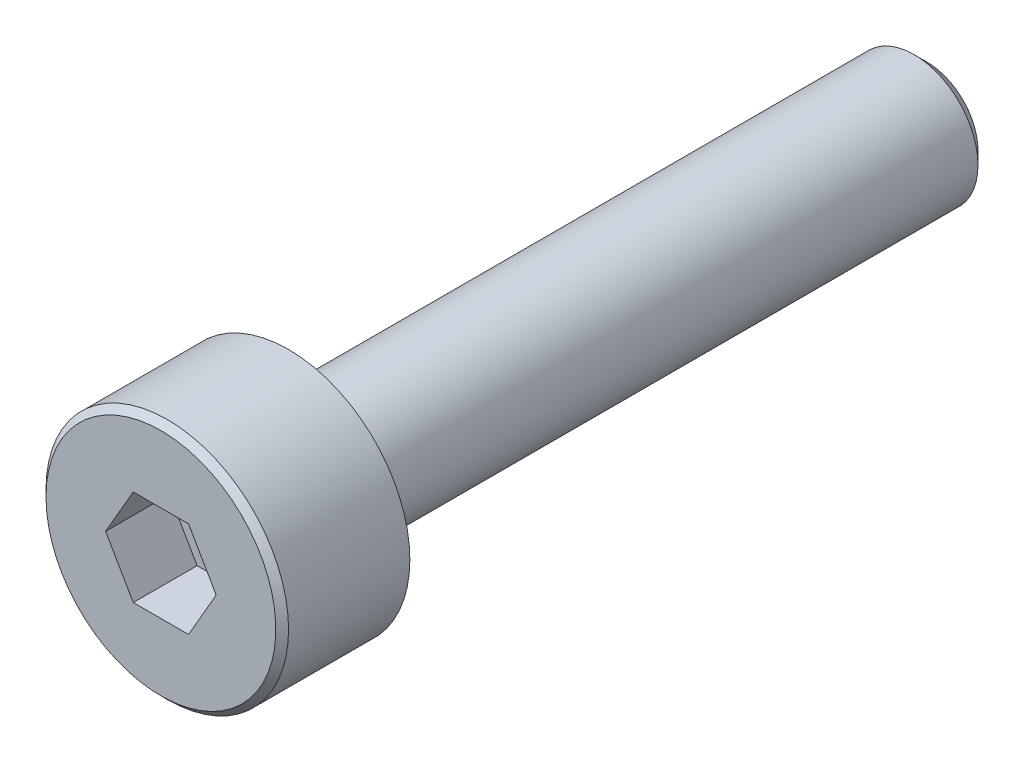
ISO-10303-21;
HEADER;
FILE_DESCRIPTION(('STEP AP214'),'2;1');
FILE_NAME('part.step','',(''),(''),'','','');
FILE_SCHEMA(('AUTOMOTIVE_DESIGN { 1 0 10303 214 1 1 1 1 }'));
ENDSEC;
DATA;
#1=APPLICATION_CONTEXT('core data for automotive mechanical design processes');
#2=APPLICATION_PROTOCOL_DEFINITION('international standard','automotive_design',2000,#1);
#3=PRODUCT_CONTEXT('',#1,'mechanical');
#4=PRODUCT('Part','Part','',(#3));
#5=PRODUCT_RELATED_PRODUCT_CATEGORY('part','',(#4));
#6=PRODUCT_DEFINITION_FORMATION('','',#4);
#7=PRODUCT_DEFINITION_CONTEXT('part definition',#1,'design');
#8=PRODUCT_DEFINITION('design','',#6,#7);
#9=PRODUCT_DEFINITION_SHAPE('','',#8);
#10=(LENGTH_UNIT() NAMED_UNIT(*) SI_UNIT(.MILLI.,.METRE.));
#11=(NAMED_UNIT(*) PLANE_ANGLE_UNIT() SI_UNIT($,.RADIAN.));
#12=(NAMED_UNIT(*) SI_UNIT($,.STERADIAN.) SOLID_ANGLE_UNIT());
#13=UNCERTAINTY_MEASURE_WITH_UNIT(LENGTH_MEASURE(1.E-05),#10,'distance_accuracy_value','');
#14=(GEOMETRIC_REPRESENTATION_CONTEXT(3) GLOBAL_UNCERTAINTY_ASSIGNED_CONTEXT((#13)) GLOBAL_UNIT_ASSIGNED_CONTEXT((#10,
#11,#12)) REPRESENTATION_CONTEXT('',''));
#15=CARTESIAN_POINT('',(0.,0.,0.));
#16=DIRECTION('',(0.,0.,1.));
#17=DIRECTION('',(1.,0.,0.));
#18=AXIS2_PLACEMENT_3D('',#15,#16,#17);
#19=CARTESIAN_POINT('',(-0.433012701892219,-0.75,1.));
#20=DIRECTION('',(0.,0.,-1.));
#21=DIRECTION('',(-1.,0.,0.));
#22=AXIS2_PLACEMENT_3D('',#19,#20,#21);
#23=PLANE('',#22);
#24=DIRECTION('',(-0.5,0.866025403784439,0.));
#25=VECTOR('',#24,1.);
#26=CARTESIAN_POINT('',(0.866025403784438,0.,1.));
#27=LINE('',#26,#25);
#28=CARTESIAN_POINT('',(0.866025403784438,0.,1.));
#29=VERTEX_POINT('',#28);
#30=CARTESIAN_POINT('',(0.433012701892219,0.75,1.));
#31=VERTEX_POINT('',#30);
#32=EDGE_CURVE('E72',#29,#31,#27,.T.);
#33=ORIENTED_EDGE('',*,*,#32,.T.);
#34=DIRECTION('',(-1.,0.,0.));
#35=VECTOR('',#34,1.);
#36=CARTESIAN_POINT('',(0.433012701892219,0.75,1.));
#37=LINE('',#36,#35);
#38=CARTESIAN_POINT('',(-0.433012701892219,0.75,1.));
#39=VERTEX_POINT('',#38);
#40=EDGE_CURVE('E125',#31,#39,#37,.T.);
#41=ORIENTED_EDGE('',*,*,#40,.T.);
#42=DIRECTION('',(-0.5,-0.866025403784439,0.));
#43=VECTOR('',#42,1.);
#44=CARTESIAN_POINT('',(-0.433012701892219,0.75,1.));
#45=LINE('',#44,#43);
#46=CARTESIAN_POINT('',(-0.866025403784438,0.,1.));
#47=VERTEX_POINT('',#46);
#48=EDGE_CURVE('E130',#39,#47,#45,.T.);
#49=ORIENTED_EDGE('',*,*,#48,.T.);
#50=DIRECTION('',(0.5,-0.866025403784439,0.));
#51=VECTOR('',#50,1.);
#52=CARTESIAN_POINT('',(-0.866025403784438,0.,1.));
#53=LINE('',#52,#51);
#54=CARTESIAN_POINT('',(-0.433012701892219,-0.75,1.));
#55=VERTEX_POINT('',#54);
#56=EDGE_CURVE('E134',#47,#55,#53,.T.);
#57=ORIENTED_EDGE('',*,*,#56,.T.);
#58=DIRECTION('',(1.,0.,0.));
#59=VECTOR('',#58,1.);
#60=CARTESIAN_POINT('',(-0.433012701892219,-0.75,1.));
#61=LINE('',#60,#59);
#62=CARTESIAN_POINT('',(0.433012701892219,-0.75,1.));
#63=VERTEX_POINT('',#62);
#64=EDGE_CURVE('E68',#55,#63,#61,.T.);
#65=ORIENTED_EDGE('',*,*,#64,.T.);
#66=DIRECTION('',(0.5,0.866025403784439,0.));
#67=VECTOR('',#66,1.);
#68=CARTESIAN_POINT('',(0.433012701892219,-0.75,1.));
#69=LINE('',#68,#67);
#70=EDGE_CURVE('E70',#63,#29,#69,.T.);
#71=ORIENTED_EDGE('',*,*,#70,.T.);
#72=EDGE_LOOP('',(#33,#41,#49,#57,#65,#71));
#73=FACE_BOUND('',#72,.T.);
#74=ADVANCED_FACE('F17',(#73),#23,.F.);
#75=CARTESIAN_POINT('',(0.866025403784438,0.,1.));
#76=DIRECTION('',(0.866025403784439,0.5,0.));
#77=DIRECTION('',(-0.5,0.866025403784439,0.));
#78=AXIS2_PLACEMENT_3D('',#75,#76,#77);
#79=PLANE('',#78);
#80=ORIENTED_EDGE('',*,*,#32,.F.);
#81=DIRECTION('',(0.,0.,1.));
#82=VECTOR('',#81,1.);
#83=CARTESIAN_POINT('',(0.866025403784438,0.,1.));
#84=LINE('',#83,#82);
#85=CARTESIAN_POINT('',(0.866025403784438,0.,2.));
#86=VERTEX_POINT('',#85);
#87=EDGE_CURVE('E77',#29,#86,#84,.T.);
#88=ORIENTED_EDGE('',*,*,#87,.T.);
#89=DIRECTION('',(0.5,-0.866025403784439,0.));
#90=VECTOR('',#89,1.);
#91=CARTESIAN_POINT('',(0.433012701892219,0.75,2.));
#92=LINE('',#91,#90);
#93=CARTESIAN_POINT('',(0.433012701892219,0.75,2.));
#94=VERTEX_POINT('',#93);
#95=EDGE_CURVE('E122',#94,#86,#92,.T.);
#96=ORIENTED_EDGE('',*,*,#95,.F.);
#97=DIRECTION('',(0.,0.,1.));
#98=VECTOR('',#97,1.);
#99=CARTESIAN_POINT('',(0.433012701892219,0.75,1.));
#100=LINE('',#99,#98);
#101=EDGE_CURVE('E83',#94,#31,#100,.F.);
#102=ORIENTED_EDGE('',*,*,#101,.T.);
#103=EDGE_LOOP('',(#80,#88,#96,#102));
#104=FACE_BOUND('',#103,.T.);
#105=ADVANCED_FACE('F80',(#104),#79,.F.);
#106=CARTESIAN_POINT('',(0.433012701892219,-0.75,1.));
#107=DIRECTION('',(0.866025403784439,-0.5,0.));
#108=DIRECTION('',(0.5,0.866025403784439,0.));
#109=AXIS2_PLACEMENT_3D('',#106,#107,#108);
#110=PLANE('',#109);
#111=ORIENTED_EDGE('',*,*,#70,.F.);
#112=DIRECTION('',(0.,0.,-1.));
#113=VECTOR('',#112,1.);
#114=CARTESIAN_POINT('',(0.433012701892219,-0.75,1.));
#115=LINE('',#114,#113);
#116=CARTESIAN_POINT('',(0.433012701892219,-0.75,2.));
#117=VERTEX_POINT('',#116);
#118=EDGE_CURVE('E91',#63,#117,#115,.F.);
#119=ORIENTED_EDGE('',*,*,#118,.T.);
#120=DIRECTION('',(-0.5,-0.866025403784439,0.));
#121=VECTOR('',#120,1.);
#122=CARTESIAN_POINT('',(0.866025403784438,0.,2.));
#123=LINE('',#122,#121);
#124=EDGE_CURVE('E88',#86,#117,#123,.T.);
#125=ORIENTED_EDGE('',*,*,#124,.F.);
#126=ORIENTED_EDGE('',*,*,#87,.F.);
#127=EDGE_LOOP('',(#111,#119,#125,#126));
#128=FACE_BOUND('',#127,.T.);
#129=ADVANCED_FACE('F86',(#128),#110,.F.);
#130=CARTESIAN_POINT('',(-0.433012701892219,-0.75,1.));
#131=DIRECTION('',(0.,-1.,0.));
#132=DIRECTION('',(0.,0.,-1.));
#133=AXIS2_PLACEMENT_3D('',#130,#131,#132);
#134=PLANE('',#133);
#135=ORIENTED_EDGE('',*,*,#64,.F.);
#136=DIRECTION('',(0.,0.,1.));
#137=VECTOR('',#136,1.);
#138=CARTESIAN_POINT('',(-0.433012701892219,-0.75,1.));
#139=LINE('',#138,#137);
#140=CARTESIAN_POINT('',(-0.433012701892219,-0.75,2.));
#141=VERTEX_POINT('',#140);
#142=EDGE_CURVE('E132',#55,#141,#139,.T.);
#143=ORIENTED_EDGE('',*,*,#142,.T.);
#144=DIRECTION('',(1.,0.,0.));
#145=VECTOR('',#144,1.);
#146=CARTESIAN_POINT('',(0.,-0.75,2.));
#147=LINE('',#146,#145);
#148=EDGE_CURVE('E118',#117,#141,#147,.F.);
#149=ORIENTED_EDGE('',*,*,#148,.F.);
#150=ORIENTED_EDGE('',*,*,#118,.F.);
#151=EDGE_LOOP('',(#135,#143,#149,#150));
#152=FACE_BOUND('',#151,.T.);
#153=ADVANCED_FACE('F137',(#152),#134,.F.);
#154=CARTESIAN_POINT('',(-0.866025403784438,0.,1.));
#155=DIRECTION('',(-0.866025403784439,-0.5,0.));
#156=DIRECTION('',(0.5,-0.866025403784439,0.));
#157=AXIS2_PLACEMENT_3D('',#154,#155,#156);
#158=PLANE('',#157);
#159=ORIENTED_EDGE('',*,*,#56,.F.);
#160=DIRECTION('',(0.,0.,1.));
#161=VECTOR('',#160,1.);
#162=CARTESIAN_POINT('',(-0.866025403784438,0.,1.));
#163=LINE('',#162,#161);
#164=CARTESIAN_POINT('',(-0.866025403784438,0.,2.));
#165=VERTEX_POINT('',#164);
#166=EDGE_CURVE('E128',#47,#165,#163,.T.);
#167=ORIENTED_EDGE('',*,*,#166,.T.);
#168=DIRECTION('',(-0.5,0.866025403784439,0.));
#169=VECTOR('',#168,1.);
#170=CARTESIAN_POINT('',(-0.433012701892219,-0.75,2.));
#171=LINE('',#170,#169);
#172=EDGE_CURVE('E115',#141,#165,#171,.T.);
#173=ORIENTED_EDGE('',*,*,#172,.F.);
#174=ORIENTED_EDGE('',*,*,#142,.F.);
#175=EDGE_LOOP('',(#159,#167,#173,#174));
#176=FACE_BOUND('',#175,.T.);
#177=ADVANCED_FACE('F148',(#176),#158,.F.);
#178=CARTESIAN_POINT('',(-0.433012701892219,0.75,1.));
#179=DIRECTION('',(-0.866025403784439,0.5,0.));
#180=DIRECTION('',(-0.5,-0.866025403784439,0.));
#181=AXIS2_PLACEMENT_3D('',#178,#179,#180);
#182=PLANE('',#181);
#183=ORIENTED_EDGE('',*,*,#48,.F.);
#184=DIRECTION('',(0.,0.,1.));
#185=VECTOR('',#184,1.);
#186=CARTESIAN_POINT('',(-0.433012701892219,0.75,1.));
#187=LINE('',#186,#185);
#188=CARTESIAN_POINT('',(-0.433012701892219,0.75,2.));
#189=VERTEX_POINT('',#188);
#190=EDGE_CURVE('E35',#39,#189,#187,.T.);
#191=ORIENTED_EDGE('',*,*,#190,.T.);
#192=DIRECTION('',(0.5,0.866025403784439,0.));
#193=VECTOR('',#192,1.);
#194=CARTESIAN_POINT('',(-0.866025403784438,0.,2.));
#195=LINE('',#194,#193);
#196=EDGE_CURVE('E112',#165,#189,#195,.T.);
#197=ORIENTED_EDGE('',*,*,#196,.F.);
#198=ORIENTED_EDGE('',*,*,#166,.F.);
#199=EDGE_LOOP('',(#183,#191,#197,#198));
#200=FACE_BOUND('',#199,.T.);
#201=ADVANCED_FACE('F146',(#200),#182,.F.);
#202=CARTESIAN_POINT('',(0.433012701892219,0.75,1.));
#203=DIRECTION('',(0.,1.,0.));
#204=DIRECTION('',(-1.,0.,0.));
#205=AXIS2_PLACEMENT_3D('',#202,#203,#204);
#206=PLANE('',#205);
#207=ORIENTED_EDGE('',*,*,#40,.F.);
#208=ORIENTED_EDGE('',*,*,#101,.F.);
#209=DIRECTION('',(1.,0.,0.));
#210=VECTOR('',#209,1.);
#211=CARTESIAN_POINT('',(0.,0.75,2.));
#212=LINE('',#211,#210);
#213=EDGE_CURVE('E107',#189,#94,#212,.T.);
#214=ORIENTED_EDGE('',*,*,#213,.F.);
#215=ORIENTED_EDGE('',*,*,#190,.F.);
#216=EDGE_LOOP('',(#207,#208,#214,#215));
#217=FACE_BOUND('',#216,.T.);
#218=ADVANCED_FACE('F143',(#217),#206,.F.);
#219=CARTESIAN_POINT('',(0.,0.,2.));
#220=DIRECTION('',(0.,0.,1.));
#221=DIRECTION('',(1.,0.,0.));
#222=AXIS2_PLACEMENT_3D('',#219,#220,#221);
#223=PLANE('',#222);
#224=CARTESIAN_POINT('',(0.,0.,2.00000000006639));
#225=DIRECTION('',(0.,0.,-1.));
#226=DIRECTION('',(-1.,0.,0.));
#227=AXIS2_PLACEMENT_3D('',#224,#225,#226);
#228=CIRCLE('',#227,1.80000000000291);
#229=CARTESIAN_POINT('',(-1.80000000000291,0.,2.00000000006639));
#230=VERTEX_POINT('',#229);
#231=EDGE_CURVE('E20',#230,#230,#228,.T.);
#232=ORIENTED_EDGE('',*,*,#231,.F.);
#233=EDGE_LOOP('',(#232));
#234=FACE_BOUND('',#233,.T.);
#235=ORIENTED_EDGE('',*,*,#196,.T.);
#236=ORIENTED_EDGE('',*,*,#213,.T.);
#237=ORIENTED_EDGE('',*,*,#95,.T.);
#238=ORIENTED_EDGE('',*,*,#124,.T.);
#239=ORIENTED_EDGE('',*,*,#148,.T.);
#240=ORIENTED_EDGE('',*,*,#172,.T.);
#241=EDGE_LOOP('',(#235,#236,#237,#238,#239,#240));
#242=FACE_BOUND('',#241,.T.);
#243=ADVANCED_FACE('F141',(#234,#242),#223,.T.);
#244=CARTESIAN_POINT('',(0.,0.,1.90000000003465));
#245=DIRECTION('',(0.,0.,-1.));
#246=DIRECTION('',(-1.,0.,0.));
#247=AXIS2_PLACEMENT_3D('',#244,#245,#246);
#248=CONICAL_SURFACE('',#247,1.90000000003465,0.785398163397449);
#249=ORIENTED_EDGE('',*,*,#231,.T.);
#250=EDGE_LOOP('',(#249));
#251=FACE_BOUND('',#250,.T.);
#252=CARTESIAN_POINT('',(0.,0.,1.9));
#253=DIRECTION('',(0.,0.,-1.));
#254=DIRECTION('',(-1.,0.,0.));
#255=AXIS2_PLACEMENT_3D('',#252,#253,#254);
#256=CIRCLE('',#255,1.9);
#257=CARTESIAN_POINT('',(-1.9,0.,1.9));
#258=VERTEX_POINT('',#257);
#259=EDGE_CURVE('E99',#258,#258,#256,.T.);
#260=ORIENTED_EDGE('',*,*,#259,.F.);
#261=EDGE_LOOP('',(#260));
#262=FACE_BOUND('',#261,.T.);
#263=ADVANCED_FACE('F180',(#251,#262),#248,.T.);
#264=CARTESIAN_POINT('',(0.,0.,-10.));
#265=DIRECTION('',(0.,0.,-1.));
#266=DIRECTION('',(-1.,0.,0.));
#267=AXIS2_PLACEMENT_3D('',#264,#265,#266);
#268=PLANE('',#267);
#269=CARTESIAN_POINT('',(0.,0.,-10.0000000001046));
#270=DIRECTION('',(0.,0.,1.));
#271=DIRECTION('',(1.,0.,0.));
#272=AXIS2_PLACEMENT_3D('',#269,#270,#271);
#273=CIRCLE('',#272,0.79999999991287);
#274=CARTESIAN_POINT('',(0.79999999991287,0.,-10.0000000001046));
#275=VERTEX_POINT('',#274);
#276=EDGE_CURVE('E97',#275,#275,#273,.T.);
#277=ORIENTED_EDGE('',*,*,#276,.F.);
#278=EDGE_LOOP('',(#277));
#279=FACE_BOUND('',#278,.T.);
#280=ADVANCED_FACE('F177',(#279),#268,.T.);
#281=CARTESIAN_POINT('',(0.,0.,2.));
#282=DIRECTION('',(0.,0.,-1.));
#283=DIRECTION('',(-1.,0.,0.));
#284=AXIS2_PLACEMENT_3D('',#281,#282,#283);
#285=CYLINDRICAL_SURFACE('',#284,1.9);
#286=ORIENTED_EDGE('',*,*,#259,.T.);
#287=EDGE_LOOP('',(#286));
#288=FACE_BOUND('',#287,.T.);
#289=CARTESIAN_POINT('',(0.,0.,0.));
#290=DIRECTION('',(0.,0.,-1.));
#291=DIRECTION('',(-1.,0.,0.));
#292=AXIS2_PLACEMENT_3D('',#289,#290,#291);
#293=CIRCLE('',#292,1.9);
#294=CARTESIAN_POINT('',(-1.9,0.,0.));
#295=VERTEX_POINT('',#294);
#296=EDGE_CURVE('E95',#295,#295,#293,.F.);
#297=ORIENTED_EDGE('',*,*,#296,.T.);
#298=EDGE_LOOP('',(#297));
#299=FACE_BOUND('',#298,.T.);
#300=ADVANCED_FACE('F173',(#288,#299),#285,.T.);
#301=CARTESIAN_POINT('',(0.,0.,-9.80000000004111));
#302=DIRECTION('',(0.,0.,1.));
#303=DIRECTION('',(1.,0.,0.));
#304=AXIS2_PLACEMENT_3D('',#301,#302,#303);
#305=CONICAL_SURFACE('',#304,0.999999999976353,0.785398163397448);
#306=CARTESIAN_POINT('',(0.,0.,-9.8));
#307=DIRECTION('',(0.,0.,1.));
#308=DIRECTION('',(1.,0.,0.));
#309=AXIS2_PLACEMENT_3D('',#306,#307,#308);
#310=CIRCLE('',#309,1.);
#311=CARTESIAN_POINT('',(1.,0.,-9.8));
#312=VERTEX_POINT('',#311);
#313=EDGE_CURVE('E26',#312,#312,#310,.T.);
#314=ORIENTED_EDGE('',*,*,#313,.F.);
#315=EDGE_LOOP('',(#314));
#316=FACE_BOUND('',#315,.T.);
#317=ORIENTED_EDGE('',*,*,#276,.T.);
#318=EDGE_LOOP('',(#317));
#319=FACE_BOUND('',#318,.T.);
#320=ADVANCED_FACE('F166',(#316,#319),#305,.T.);
#321=CARTESIAN_POINT('',(0.,0.,0.));
#322=DIRECTION('',(0.,0.,1.));
#323=DIRECTION('',(1.,0.,0.));
#324=AXIS2_PLACEMENT_3D('',#321,#322,#323);
#325=PLANE('',#324);
#326=ORIENTED_EDGE('',*,*,#296,.F.);
#327=EDGE_LOOP('',(#326));
#328=FACE_BOUND('',#327,.T.);
#329=CARTESIAN_POINT('',(0.,0.,0.));
#330=DIRECTION('',(0.,0.,1.));
#331=DIRECTION('',(1.,0.,0.));
#332=AXIS2_PLACEMENT_3D('',#329,#330,#331);
#333=CIRCLE('',#332,1.);
#334=CARTESIAN_POINT('',(1.,0.,0.));
#335=VERTEX_POINT('',#334);
#336=EDGE_CURVE('E11',#335,#335,#333,.F.);
#337=ORIENTED_EDGE('',*,*,#336,.F.);
#338=EDGE_LOOP('',(#337));
#339=FACE_BOUND('',#338,.T.);
#340=ADVANCED_FACE('F160',(#328,#339),#325,.F.);
#341=CARTESIAN_POINT('',(0.,0.,-10.));
#342=DIRECTION('',(0.,0.,1.));
#343=DIRECTION('',(1.,0.,0.));
#344=AXIS2_PLACEMENT_3D('',#341,#342,#343);
#345=CYLINDRICAL_SURFACE('',#344,1.);
#346=ORIENTED_EDGE('',*,*,#336,.T.);
#347=EDGE_LOOP('',(#346));
#348=FACE_BOUND('',#347,.T.);
#349=ORIENTED_EDGE('',*,*,#313,.T.);
#350=EDGE_LOOP('',(#349));
#351=FACE_BOUND('',#350,.T.);
#352=ADVANCED_FACE('F158',(#348,#351),#345,.T.);
#353=CLOSED_SHELL('',(#74,#105,#129,#153,#177,#201,#218,#243,#263,#280,#300,#320,#340,#352));
#354=MANIFOLD_SOLID_BREP('B1',#353);
#355=ADVANCED_BREP_SHAPE_REPRESENTATION('',(#18,#354),#14);
#356=SHAPE_DEFINITION_REPRESENTATION(#9,#355);
ENDSEC;
END-ISO-10303-21;
